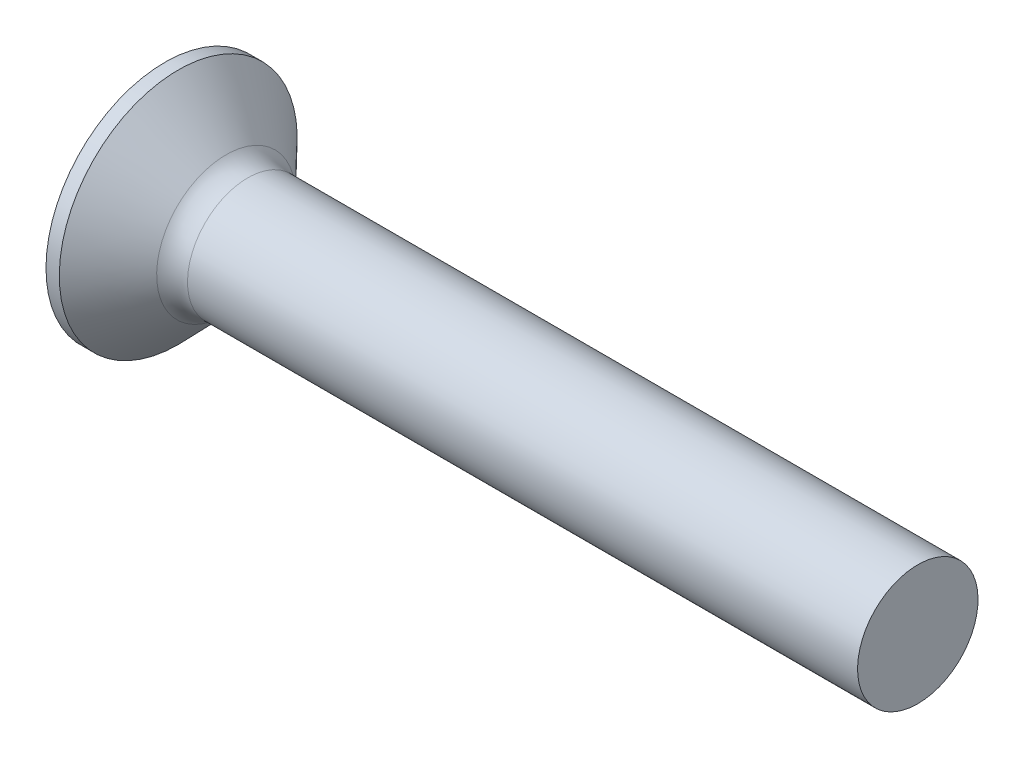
from build123d import *

# Parameters (mm, degrees)
FILLET1_R    = 2
RECPAT_COUNT = 2
RECPAT_ANGLE = 90


with BuildPart() as part:
    # BodySke → BaseBody (revolve)
    with BuildSketch(Plane.XY, mode=Mode.PRIVATE) as basebody_sk:
        with BuildLine():
            Line((2.01414483, 7.9), (2.897958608, 7.9))
            Line((2.897958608, 7.9), (6.66414483, 4))
            Line((6.66414483, 4), (52.01414483, 4))
            Line((52.01414483, 4), (52.01414483, 0))
            Line((52.01414483, 0), (2.01414483, 0))
            Line((2.01414483, 0), (0, 0))
            ThreePointArc((0, 0), (0.511463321, 4.076358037), (2.01414483, 7.9))
        make_face()
    revolve(basebody_sk.sketch.rotate(Axis((2.01414483, 0, 0), (1, 0, 0)), 180), axis=Axis((2.01414483, 0, 0), (1, 0, 0)))

    # Fillet1
    fillet1_edges = [part.edges().sort_by_distance(p)[0] for p in [
        (6.66414483, 4, 0),
    ]]
    fillet(fillet1_edges, radius=FILLET1_R)

    # RecSkeTop → Recess section 0
    with BuildSketch(Plane(origin=(0, 0, 0), x_dir=(0, 0, -1), z_dir=(1, 0, 0))):
        with BuildLine():
            Line((-0.946, 4.3), (0.946, 4.3))
            Line((0.946, 4.3), (0.946, -4.3))
            Line((0.946, -4.3), (-0.946, -4.3))
            Line((-0.946, -4.3), (-0.946, 4.3))
        make_face()
    # RecSkeBot → Recess section 1
    with BuildSketch(Plane(origin=(5.18, 0, 0), x_dir=(0, 0, -1), z_dir=(1, 0, 0))):
        with BuildLine():
            Line((-0.946, 1.717347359), (0.946, 1.717347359))
            Line((0.946, 1.717347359), (0.946, -1.717347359))
            Line((0.946, -1.717347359), (-0.946, -1.717347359))
            Line((-0.946, -1.717347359), (-0.946, 1.717347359))
        make_face()
    recess = loft(mode=Mode.SUBTRACT)

    # RecPat: Recess ×2 about axis
    recpat_axis = Axis((0, 0, 0), (1, 0, 0))
    for i in range(1, RECPAT_COUNT):
        add(recess.rotate(recpat_axis, i * RECPAT_ANGLE / (RECPAT_COUNT - 1)), mode=Mode.SUBTRACT)

    # RecCorSke → RecessCore (revolve, cut)
    with BuildSketch(Plane.XY, mode=Mode.PRIVATE) as recesscore_sk:
        Polygon((0, 0), (0, 2.0812), (5.18, 1.718979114), (5.738530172, 0), align=None)
    revolve(recesscore_sk.sketch.rotate(Axis((0, 0, 0), (1, 0, 0)), 90), axis=Axis((0, 0, 0), (1, 0, 0)), mode=Mode.SUBTRACT)


solid = part.part
